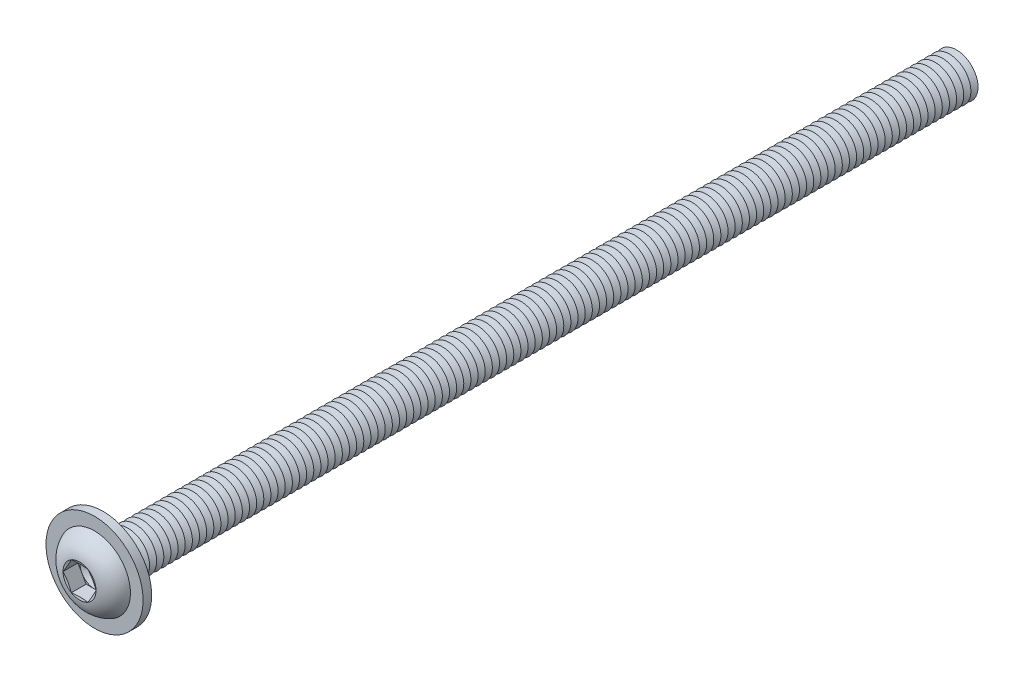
from build123d import *

# Parameters (mm, degrees)
FILLET1_R           = 0.5
LPATTERN1_COUNT     = 120
LPATTERN1_PITCH     = 1
CUT_EXTRUDE1_DEPTH  = 2.08
SKETCH5_R           = 6.8
SKETCH5_R_2         = 3.5
BOSS_EXTRUDE1_DEPTH = 1.2


with BuildPart() as part:
    # Sketch1 → Revolve1 (revolve)
    with BuildSketch(Plane(origin=(0, 0, 0), x_dir=(0, 0, -1), z_dir=(1, 0, 0))):
        with BuildLine():
            Line((0, 3), (0, 5.25))
            ThreePointArc((0, 5.25), (-2.210041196, 4.408189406), (-3.3, 2.3094))
            Line((-3.3, 2.3094), (-2.990599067, 1.1547))
            Line((-2.990599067, 1.1547), (-3.3, 1.1547))
            Line((-3.3, 1.1547), (-3.3, 0))
            Line((-3.3, 0), (120, 0))
            Line((120, 0), (120, 3))
            Line((120, 3), (0, 3))
        make_face()
    revolve(axis=Axis((0, 0, -120), (0, 0, 1)))

    # Fillet1
    fillet1_edges = [part.edges().sort_by_distance(p)[0] for p in [
        (0, -3, 0),
    ]]
    fillet(fillet1_edges, radius=FILLET1_R)

    # Sketch2 → Cut-Revolve1 (revolve, cut)
    with BuildSketch(Plane(origin=(0, 0, 0), x_dir=(0, 0, -1), z_dir=(1, 0, 0))):
        Polygon((119.5, 3), (120.5, 3), (120, 2.133974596), align=None)
    cut_revolve1 = revolve(axis=Axis((0, 0, -120), (0, 0, -1)), mode=Mode.SUBTRACT)

    # LPattern1: Cut-Revolve1 ×120
    with Locations(*[(0, 0, i * LPATTERN1_PITCH) for i in range(1, LPATTERN1_COUNT)]):
        add(cut_revolve1, mode=Mode.SUBTRACT)

    # Sketch3 → Cut-Extrude1 (cut)
    with BuildSketch(Plane.XY.offset(3.3)):
        Polygon((1.1547, 1.999999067), (-1.1547, 1.999999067), (-2.3094, 0), (-1.1547, -1.999999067), (1.1547, -1.999999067), (2.3094, 0), align=None)
    extrude(amount=-CUT_EXTRUDE1_DEPTH, mode=Mode.SUBTRACT)

    # Cut-Extrude2 cone 1 section (on through the dimple's axis) → Cut-Extrude2 (revolve, cut)
    with BuildSketch(Plane(origin=(0, 0, 1.22), x_dir=(0, -1, 0), z_dir=(1, 0, 0))):
        Polygon((0, 0), (1.999999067, 0), (0, 1.1547), align=None)
    revolve(axis=Axis((0, 0, 1.22), (0, 0, -1)), mode=Mode.SUBTRACT)

    # Sketch5 → Boss-Extrude1 (add)
    with BuildSketch(Plane(origin=(0, 0, 0), x_dir=(-1, 0, 0), z_dir=(0, 0, -1))):
        with Locations(Location((0, 0, 0), (0, 0, 90))):
            Circle(SKETCH5_R)
        Circle(SKETCH5_R_2, mode=Mode.SUBTRACT)
    extrude(amount=-BOSS_EXTRUDE1_DEPTH)


solid = part.part
